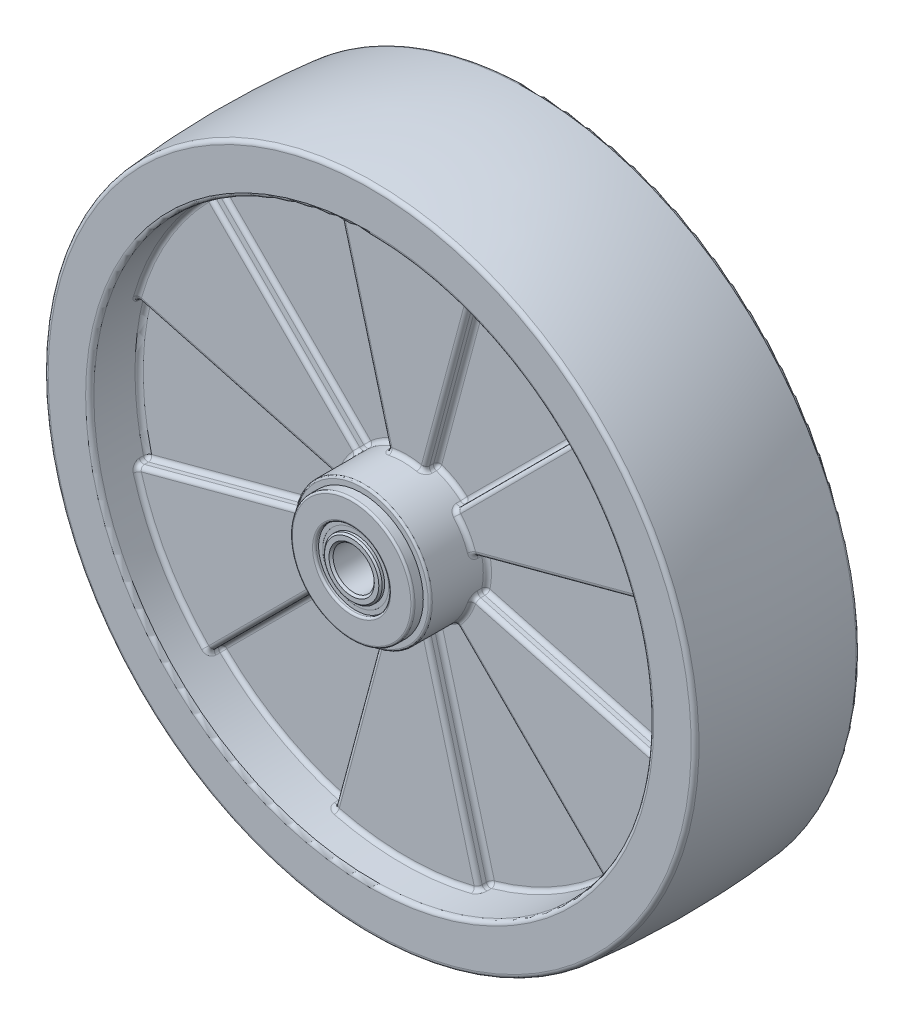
from build123d import *

# Parameters (mm, degrees)
SKETCH86_W              = 15.875
SKETCH86_H              = 85.822842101
SKETCH3_R               = 21.082
BOSS_EXTRUDE2_DEPTH     = 27.78125
SKETCH4_R               = 18.923
BOSS_EXTRUDE3_DEPTH     = 3.175
CUT_EXTRUDE1_DEPTH      = 147.98098331
CUT_EXTRUDE1_DEPTH_BACK = 147.98098331
SKETCH26_R              = 11.43
SKETCH93_R              = 85.822842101
SKETCH93_R_2            = 21.082
BOSS_EXTRUDE22_DEPTH    = 15.875
BOSS_EXTRUDE23_START    = -15.875
SKETCH94_R              = 85.822842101
SKETCH94_R_2            = 21.082
BOSS_EXTRUDE23_DEPTH    = 15.875
SKETCH95_R              = 8.89
SKETCH95_R_2            = 6.35
BOSS_EXTRUDE25_DEPTH    = 61.9125
SKETCH99_R              = 10.16
SKETCH99_R_2            = 8.89
BOSS_EXTRUDE28_DEPTH    = 29.68625
BOSS_EXTRUDE30_START    = 0.0254
SKETCH100_R             = 11.43
SKETCH100_R_2           = 10.16
BOSS_EXTRUDE30_DEPTH    = 29.7434
CHAMFER4_SIZE           = 0.508
CHAMFER5_SIZE           = 0.635
FILLET16_R              = 0.635
SKETCH101_W             = 65.278
SKETCH101_H             = 15.24
BOSS_EXTRUDE31_START    = 3.81
BOSS_EXTRUDE31_DEPTH    = 3.81
CIRPATTERN2_COUNT       = 6
MIRROR26_START          = 3.81
MIRROR26_COPY_1_DEPTH   = 3.81
MIRROR26_COPY_2_DEPTH   = 3.81
MIRROR26_COPY_3_DEPTH   = 3.81
MIRROR26_COPY_4_DEPTH   = 3.81
MIRROR26_COPY_5_DEPTH   = 3.81
FILLET17_R              = 1.27
FILLET18_R              = 1.27


with BuildPart() as part:
    # Sketch1 → Revolve1 (revolve)
    with BuildSketch(Plane(origin=(0, 0, 0), x_dir=(0, 0, -1), z_dir=(1, 0, 0)), mode=Mode.PRIVATE) as revolve1_sk:
        with BuildLine():
            ThreePointArc((25.4, -100.326809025), (0, -101.6), (-25.4, -100.326809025))
            Line((-25.4, -100.326809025), (-25.4, -85.822842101))
            Line((-25.4, -85.822842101), (-25.4, 0))
            Line((-25.4, 0), (-9.525, 0))
            Line((-9.525, 0), (9.525, 0))
            Line((9.525, 0), (25.4, 0))
            Line((25.4, 0), (25.4, -85.822842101))
            Line((25.4, -85.822842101), (25.4, -100.326809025))
        make_face()
    revolve(revolve1_sk.sketch.rotate(Axis((0, 0, 86.96894761), (0, 0, -1)), 270), axis=Axis((0, 0, 86.96894761), (0, 0, -1)))

    # Sketch86 → Cut-Revolve1 (revolve, cut)
    with BuildSketch(Plane(origin=(0, 0, 0), x_dir=(0, 0, -1), z_dir=(1, 0, 0)), mode=Mode.PRIVATE) as cut_revolve1_sk:
        with Locations((-17.4625, -42.911421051)):
            Rectangle(SKETCH86_W, SKETCH86_H)
        with Locations((17.4625, -42.911421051)):
            Rectangle(SKETCH86_W, SKETCH86_H)
    revolve(cut_revolve1_sk.sketch.rotate(Axis((0, 0, 25.4), (0, 0, -1)), 270), axis=Axis((0, 0, 25.4), (0, 0, -1)), mode=Mode.SUBTRACT)

    # Sketch3 → Boss-Extrude2 (add, symmetric)
    with BuildSketch(Plane.XY):
        with Locations(Location((0, 0, 0), (0, 0, 180))):
            Circle(SKETCH3_R)
    extrude(amount=BOSS_EXTRUDE2_DEPTH, both=True)

    # Sketch4 → Boss-Extrude3 (add)
    with BuildSketch(Plane.XY.offset(27.78125)):
        Circle(SKETCH4_R)
    boss_extrude3 = extrude(amount=BOSS_EXTRUDE3_DEPTH)

    # Mirror2: Boss-Extrude3 across plane
    add(boss_extrude3.mirror(Plane.XY))

    # Sketch26 → Cut-Extrude1 (cut, two sides: drawn at the far end of the back side and taken through both)
    with BuildSketch(Plane.XY.offset(-CUT_EXTRUDE1_DEPTH_BACK)):
        Circle(SKETCH26_R)
    extrude(amount=CUT_EXTRUDE1_DEPTH + CUT_EXTRUDE1_DEPTH_BACK, mode=Mode.SUBTRACT)

    # Sketch93 → Boss-Extrude22 (add)
    with BuildSketch(Plane.XY.offset(25.4)):
        Circle(SKETCH93_R)
        with Locations(Location((0, 0, 0), (0, 0, 180))):
            Circle(SKETCH93_R_2, mode=Mode.SUBTRACT)
    extrude(amount=-BOSS_EXTRUDE22_DEPTH)

    # Sketch94 → Boss-Extrude23 (add)
    with BuildSketch(Plane(origin=(0, 0, -25.4), x_dir=(-1, 0, 0), z_dir=(0, 0, -1)).offset(BOSS_EXTRUDE23_START)):
        Circle(SKETCH94_R)
        Circle(SKETCH94_R_2, mode=Mode.SUBTRACT)
    extrude(amount=BOSS_EXTRUDE23_DEPTH)



with BuildPart() as body_2:
    # Sketch95 → Boss-Extrude25 (new body)
    with BuildSketch(Plane.XY.offset(30.95625)):
        Circle(SKETCH95_R)
        Circle(SKETCH95_R_2, mode=Mode.SUBTRACT)
    extrude(amount=-BOSS_EXTRUDE25_DEPTH)

    # Sketch99 → Boss-Extrude28 (add)
    with BuildSketch(Plane.XY.offset(29.68625)):
        Circle(SKETCH99_R)
        Circle(SKETCH99_R_2, mode=Mode.SUBTRACT)
    boss_extrude28 = extrude(amount=-BOSS_EXTRUDE28_DEPTH)


with BuildPart() as part_1:
    add(part.part)

    add(body_2.part)  # Boss-Extrude30 merges body 2
    # Sketch100 → Boss-Extrude30 (add)
    with BuildSketch(Plane.XY.offset(29.68625).offset(BOSS_EXTRUDE30_START)):
        Circle(SKETCH100_R)
        Circle(SKETCH100_R_2, mode=Mode.SUBTRACT)
    boss_extrude30 = extrude(amount=-BOSS_EXTRUDE30_DEPTH)

    # Chamfer4
    chamfer4_edges = [part_1.edges().sort_by_distance(p)[0] for p in [
        (-8.89, 0, -30.95625),
        (-8.89, 0, 30.95625),
    ]]
    chamfer(chamfer4_edges, length=CHAMFER4_SIZE)

    # Mirror13: Boss-Extrude28, Boss-Extrude30 across plane
    add(boss_extrude28.mirror(Plane.XY))
    add(boss_extrude30.mirror(Plane.XY))

    # Chamfer5
    chamfer5_edges = [part_1.edges().sort_by_distance(p)[0] for p in [
        (-6.35, 0, 30.95625),
        (-6.35, 0, -30.95625),
    ]]
    chamfer(chamfer5_edges, length=CHAMFER5_SIZE)

    # Fillet16
    fillet16_edges = [part_1.edges().sort_by_distance(p)[0] for p in [
        (21.082, 0, -27.78125),
        (21.082, 0, 27.78125),
        (-18.923, 0, 30.95625),
        (-18.923, 0, -30.95625),
        (-11.43, 0, -30.95625),
        (-11.43, 0, 30.95625),
    ]]
    fillet(fillet16_edges, radius=FILLET16_R)

    # Sketch101 → Cut-Revolve2 (revolve, cut)
    with BuildSketch(Plane(origin=(0, 0, 0), x_dir=(1, 0, 0), z_dir=(0, 1, 0)), mode=Mode.PRIVATE) as cut_revolve2_sk:
        with Locations((53.721, -17.78)):
            Rectangle(SKETCH101_W, SKETCH101_H)
    cut_revolve2 = revolve(cut_revolve2_sk.sketch.rotate(Axis((0, 0, 0), (0, 0, 1)), 180), axis=Axis((0, 0, 0), (0, 0, 1)), mode=Mode.SUBTRACT)

    # Mirror14: Cut-Revolve2 across plane
    add(cut_revolve2.mirror(Plane.XY), mode=Mode.SUBTRACT)

    # Sketch102 → Boss-Extrude31 (add)
    with BuildSketch(Plane.XY.offset(10.16).offset(BOSS_EXTRUDE31_START)):
        with BuildLine():
            Line((-22.351612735, 83.417354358), (-5.456423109, 20.36364827))
            ThreePointArc((-5.456423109, 20.36364827), (0, 21.082), (5.456423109, 20.36364827))
            Line((5.456423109, 20.36364827), (22.351612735, 83.417354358))
            ThreePointArc((22.351612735, 83.417354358), (0, 86.36), (-22.351612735, 83.417354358))
        make_face()
    boss_extrude31 = extrude(amount=-BOSS_EXTRUDE31_DEPTH)

    # CirPattern2: Boss-Extrude31 ×6 about axis
    cirpattern2_axis = Axis((0, 0, 0), (0, 0, 1))
    for i in range(1, CIRPATTERN2_COUNT):
        add(boss_extrude31.rotate(cirpattern2_axis, i * 360 / CIRPATTERN2_COUNT))

    # Mirror26: Boss-Extrude31 across plane
    add(boss_extrude31.mirror(Plane.XY))

    # Mirror26 copy 1 sketch → Mirror26 copy 1 (add)
    with BuildSketch(Plane(origin=(0, 0, -10.16), x_dir=(0.5000000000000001, 0.8660254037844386, 0), z_dir=(0, 0, -1)).offset(MIRROR26_START)):
        with BuildLine():
            Line((-22.351612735, -83.417354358), (-5.456423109, -20.36364827))
            ThreePointArc((-5.456423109, -20.36364827), (0, -21.082), (5.456423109, -20.36364827))
            Line((5.456423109, -20.36364827), (22.351612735, -83.417354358))
            ThreePointArc((22.351612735, -83.417354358), (0, -86.36), (-22.351612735, -83.417354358))
        make_face()
    extrude(amount=-MIRROR26_COPY_1_DEPTH)

    # Mirror26 copy 2 sketch → Mirror26 copy 2 (add)
    with BuildSketch(Plane(origin=(0, 0, -10.16), x_dir=(-0.4999999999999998, 0.8660254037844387, 0), z_dir=(0, 0, -1)).offset(MIRROR26_START)):
        with BuildLine():
            Line((-22.351612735, -83.417354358), (-5.456423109, -20.36364827))
            ThreePointArc((-5.456423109, -20.36364827), (0, -21.082), (5.456423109, -20.36364827))
            Line((5.456423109, -20.36364827), (22.351612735, -83.417354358))
            ThreePointArc((22.351612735, -83.417354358), (0, -86.36), (-22.351612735, -83.417354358))
        make_face()
    extrude(amount=-MIRROR26_COPY_2_DEPTH)

    # Mirror26 copy 3 sketch → Mirror26 copy 3 (add)
    with BuildSketch(Plane(origin=(0, 0, -10.16), x_dir=(-1, 0, 0), z_dir=(0, 0, -1)).offset(MIRROR26_START)):
        with BuildLine():
            Line((-22.351612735, -83.417354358), (-5.456423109, -20.36364827))
            ThreePointArc((-5.456423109, -20.36364827), (0, -21.082), (5.456423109, -20.36364827))
            Line((5.456423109, -20.36364827), (22.351612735, -83.417354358))
            ThreePointArc((22.351612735, -83.417354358), (0, -86.36), (-22.351612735, -83.417354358))
        make_face()
    extrude(amount=-MIRROR26_COPY_3_DEPTH)

    # Mirror26 copy 4 sketch → Mirror26 copy 4 (add)
    with BuildSketch(Plane(origin=(0, 0, -10.16), x_dir=(-0.5000000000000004, -0.8660254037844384, 0), z_dir=(0, 0, -1)).offset(MIRROR26_START)):
        with BuildLine():
            Line((-22.351612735, -83.417354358), (-5.456423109, -20.36364827))
            ThreePointArc((-5.456423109, -20.36364827), (0, -21.082), (5.456423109, -20.36364827))
            Line((5.456423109, -20.36364827), (22.351612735, -83.417354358))
            ThreePointArc((22.351612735, -83.417354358), (0, -86.36), (-22.351612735, -83.417354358))
        make_face()
    extrude(amount=-MIRROR26_COPY_4_DEPTH)

    # Mirror26 copy 5 sketch → Mirror26 copy 5 (add)
    with BuildSketch(Plane(origin=(0, 0, -10.16), x_dir=(0.5000000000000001, -0.8660254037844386, 0), z_dir=(0, 0, -1)).offset(MIRROR26_START)):
        with BuildLine():
            Line((-22.351612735, -83.417354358), (-5.456423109, -20.36364827))
            ThreePointArc((-5.456423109, -20.36364827), (0, -21.082), (5.456423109, -20.36364827))
            Line((5.456423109, -20.36364827), (22.351612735, -83.417354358))
            ThreePointArc((22.351612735, -83.417354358), (0, -86.36), (-22.351612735, -83.417354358))
        make_face()
    extrude(amount=-MIRROR26_COPY_5_DEPTH)

    # Fillet17
    fillet17_edges = [part_1.edges().sort_by_distance(p)[0] for p in [
        (86.36, 0, 25.4),
        (86.36, 0, -25.4),
        (43.18, 74.789953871, 10.16),
        (10.541, 18.257547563, 10.16),
        (-5.456423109, 20.36364827, 12.065),
        (13.904017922, 51.890501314, 10.16),
        (5.456423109, 20.36364827, 12.065),
        (22.351612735, 83.417354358, 12.065),
        (-13.904017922, 51.890501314, 10.16),
        (-22.351612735, 83.417354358, 12.065),
        (0, 21.082, 13.97),
        (13.904017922, 51.890501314, 13.97),
        (0, 86.36, 13.97),
        (-13.904017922, 51.890501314, 13.97),
        (86.36, 0, 10.16),
        (21.082, 0, 10.16),
        (14.907225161, 14.907225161, 12.065),
        (51.890501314, 13.904017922, 10.16),
        (20.36364827, 5.456423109, 12.065),
        (83.417354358, 22.351612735, 12.065),
        (37.986483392, 37.986483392, 10.16),
        (61.065741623, 61.065741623, 12.065),
        (18.257547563, 10.541, 13.97),
        (51.890501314, 13.904017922, 13.97),
        (74.789953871, 43.18, 13.97),
        (37.986483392, 37.986483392, 13.97),
        (43.18, -74.789953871, 10.16),
        (10.541, -18.257547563, 10.16),
        (20.36364827, -5.456423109, 12.065),
        (37.986483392, -37.986483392, 10.16),
        (14.907225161, -14.907225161, 12.065),
        (61.065741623, -61.065741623, 12.065),
        (51.890501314, -13.904017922, 10.16),
        (83.417354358, -22.351612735, 12.065),
        (18.257547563, -10.541, 13.97),
        (37.986483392, -37.986483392, 13.97),
        (74.789953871, -43.18, 13.97),
        (51.890501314, -13.904017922, 13.97),
        (-43.18, -74.789953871, 10.16),
        (-10.541, -18.257547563, 10.16),
        (5.456423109, -20.36364827, 12.065),
        (-13.904017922, -51.890501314, 10.16),
        (-5.456423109, -20.36364827, 12.065),
        (-22.351612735, -83.417354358, 12.065),
        (13.904017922, -51.890501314, 10.16),
        (22.351612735, -83.417354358, 12.065),
        (0, -21.082, 13.97),
        (-13.904017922, -51.890501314, 13.97),
        (0, -86.36, 13.97),
        (13.904017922, -51.890501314, 13.97),
        (-85.621178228, 11.27224196, 10.16),
        (-20.901640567, 2.751753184, 10.16),
        (-14.907225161, -14.907225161, 12.065),
        (-51.890501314, -13.904017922, 10.16),
        (-20.36364827, -5.456423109, 12.065),
        (-83.417354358, -22.351612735, 12.065),
        (-37.986483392, -37.986483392, 10.16),
        (-61.065741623, -61.065741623, 12.065),
        (-18.257547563, -10.541, 13.97),
        (-51.890501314, -13.904017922, 13.97),
        (-74.789953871, -43.18, 13.97),
        (-37.986483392, -37.986483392, 13.97),
        (-43.18, 74.789953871, 10.16),
        (-10.541, 18.257547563, 10.16),
        (-20.36364827, 5.456423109, 12.065),
        (-37.986483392, 37.986483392, 10.16),
        (-14.907225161, 14.907225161, 12.065),
        (-61.065741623, 61.065741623, 12.065),
        (-51.890501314, 13.904017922, 10.16),
        (-83.417354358, 22.351612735, 12.065),
        (-18.257547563, 10.541, 13.97),
        (-37.986483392, 37.986483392, 13.97),
        (-74.789953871, 43.18, 13.97),
        (-51.890501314, 13.904017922, 13.97),
        (43.18, 74.789953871, -10.16),
        (10.541, 18.257547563, -10.16),
        (0, 21.082, -13.97),
        (5.456423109, 20.36364827, -12.065),
        (-13.904017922, 51.890501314, -13.97),
        (-5.456423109, 20.36364827, -12.065),
        (0, 86.36, -13.97),
        (-22.351612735, 83.417354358, -12.065),
        (13.904017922, 51.890501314, -13.97),
        (22.351612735, 83.417354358, -12.065),
        (13.904017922, 51.890501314, -10.16),
        (-13.904017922, 51.890501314, -10.16),
        (86.36, 0, -10.16),
        (21.082, 0, -10.16),
        (18.257547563, 10.541, -13.97),
        (20.36364827, 5.456423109, -12.065),
        (37.986483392, 37.986483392, -13.97),
        (14.907225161, 14.907225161, -12.065),
        (74.789953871, 43.18, -13.97),
        (61.065741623, 61.065741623, -12.065),
        (51.890501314, 13.904017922, -13.97),
        (83.417354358, 22.351612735, -12.065),
        (51.890501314, 13.904017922, -10.16),
        (37.986483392, 37.986483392, -10.16),
        (43.18, -74.789953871, -10.16),
        (10.541, -18.257547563, -10.16),
        (18.257547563, -10.541, -13.97),
        (14.907225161, -14.907225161, -12.065),
        (51.890501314, -13.904017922, -13.97),
        (20.36364827, -5.456423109, -12.065),
        (74.789953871, -43.18, -13.97),
        (83.417354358, -22.351612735, -12.065),
        (37.986483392, -37.986483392, -13.97),
        (61.065741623, -61.065741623, -12.065),
        (37.986483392, -37.986483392, -10.16),
        (51.890501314, -13.904017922, -10.16),
        (-43.18, -74.789953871, -10.16),
        (-10.541, -18.257547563, -10.16),
        (0, -21.082, -13.97),
        (-5.456423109, -20.36364827, -12.065),
        (13.904017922, -51.890501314, -13.97),
        (5.456423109, -20.36364827, -12.065),
        (0, -86.36, -13.97),
        (22.351612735, -83.417354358, -12.065),
        (-13.904017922, -51.890501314, -13.97),
        (-22.351612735, -83.417354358, -12.065),
        (-13.904017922, -51.890501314, -10.16),
        (13.904017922, -51.890501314, -10.16),
        (-85.621178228, 11.27224196, -10.16),
        (-20.901640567, 2.751753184, -10.16),
        (-18.257547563, -10.541, -13.97),
        (-20.36364827, -5.456423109, -12.065),
        (-37.986483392, -37.986483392, -13.97),
        (-14.907225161, -14.907225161, -12.065),
        (-74.789953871, -43.18, -13.97),
        (-61.065741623, -61.065741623, -12.065),
        (-51.890501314, -13.904017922, -13.97),
        (-83.417354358, -22.351612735, -12.065),
        (-51.890501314, -13.904017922, -10.16),
        (-37.986483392, -37.986483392, -10.16),
        (-43.18, 74.789953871, -10.16),
        (-10.541, 18.257547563, -10.16),
        (-18.257547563, 10.541, -13.97),
        (-14.907225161, 14.907225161, -12.065),
        (-51.890501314, 13.904017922, -13.97),
        (-20.36364827, 5.456423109, -12.065),
        (-74.789953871, 43.18, -13.97),
        (-83.417354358, 22.351612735, -12.065),
        (-37.986483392, 37.986483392, -13.97),
        (-61.065741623, 61.065741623, -12.065),
        (-37.986483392, 37.986483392, -10.16),
        (-51.890501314, 13.904017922, -10.16),
    ]]
    fillet(fillet17_edges, radius=FILLET17_R)

    # Fillet18
    fillet18_edges = [part_1.edges().sort_by_distance(p)[0] for p in [
        (-100.326809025, 0, 25.4),
        (-100.326809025, 0, -25.4),
    ]]
    fillet(fillet18_edges, radius=FILLET18_R)


solid = part_1.part
